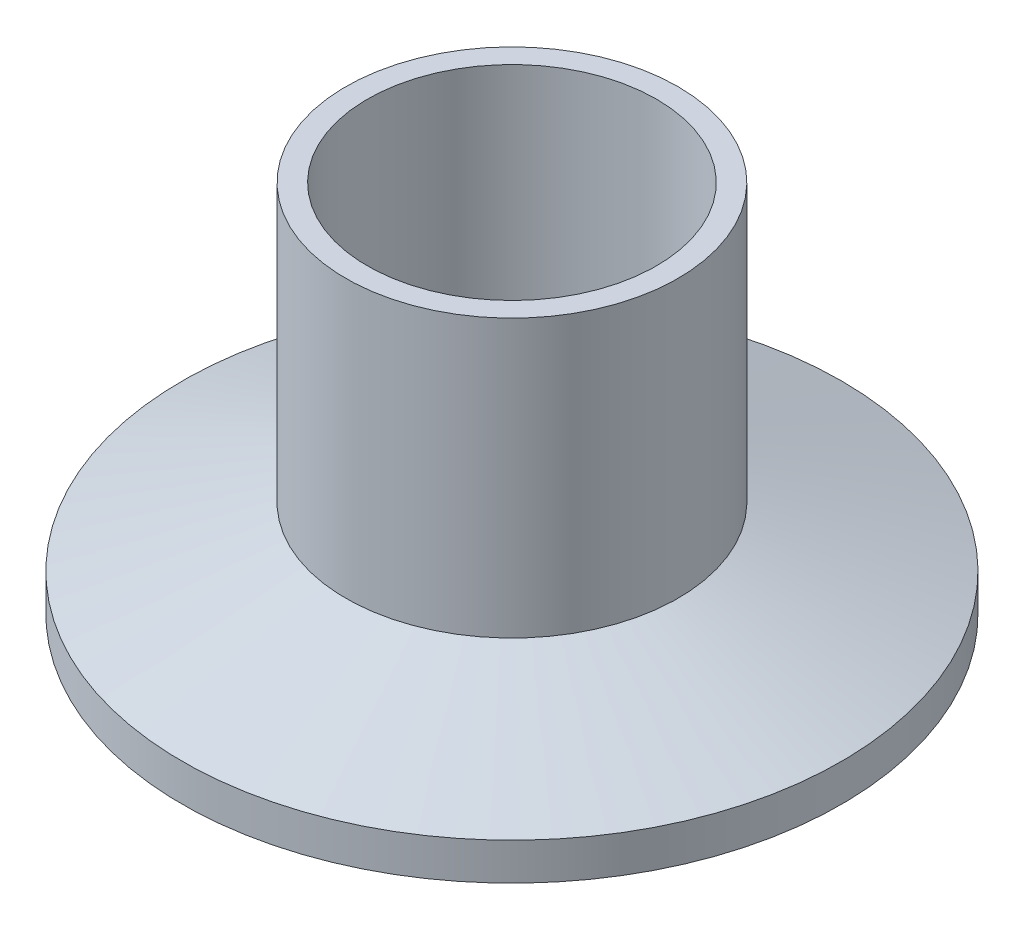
ISO-10303-21;
HEADER;
FILE_DESCRIPTION(('STEP AP214'),'2;1');
FILE_NAME('part.step','',(''),(''),'','','');
FILE_SCHEMA(('AUTOMOTIVE_DESIGN { 1 0 10303 214 1 1 1 1 }'));
ENDSEC;
DATA;
#1=APPLICATION_CONTEXT('core data for automotive mechanical design processes');
#2=APPLICATION_PROTOCOL_DEFINITION('international standard','automotive_design',2000,#1);
#3=PRODUCT_CONTEXT('',#1,'mechanical');
#4=PRODUCT('Part','Part','',(#3));
#5=PRODUCT_RELATED_PRODUCT_CATEGORY('part','',(#4));
#6=PRODUCT_DEFINITION_FORMATION('','',#4);
#7=PRODUCT_DEFINITION_CONTEXT('part definition',#1,'design');
#8=PRODUCT_DEFINITION('design','',#6,#7);
#9=PRODUCT_DEFINITION_SHAPE('','',#8);
#10=(LENGTH_UNIT() NAMED_UNIT(*) SI_UNIT(.MILLI.,.METRE.));
#11=(NAMED_UNIT(*) PLANE_ANGLE_UNIT() SI_UNIT($,.RADIAN.));
#12=(NAMED_UNIT(*) SI_UNIT($,.STERADIAN.) SOLID_ANGLE_UNIT());
#13=UNCERTAINTY_MEASURE_WITH_UNIT(LENGTH_MEASURE(1.E-05),#10,'distance_accuracy_value','');
#14=(GEOMETRIC_REPRESENTATION_CONTEXT(3) GLOBAL_UNCERTAINTY_ASSIGNED_CONTEXT((#13)) GLOBAL_UNIT_ASSIGNED_CONTEXT((#10,
#11,#12)) REPRESENTATION_CONTEXT('',''));
#15=CARTESIAN_POINT('',(0.,0.,0.));
#16=DIRECTION('',(0.,0.,1.));
#17=DIRECTION('',(1.,0.,0.));
#18=AXIS2_PLACEMENT_3D('',#15,#16,#17);
#19=CARTESIAN_POINT('',(0.,0.787400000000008,0.));
#20=DIRECTION('',(0.,-1.,0.));
#21=DIRECTION('',(0.,0.,-1.));
#22=AXIS2_PLACEMENT_3D('',#19,#20,#21);
#23=TOROIDAL_SURFACE('',#22,23.6366084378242,0.787399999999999);
#24=CARTESIAN_POINT('',(0.,0.,0.));
#25=DIRECTION('',(0.,-1.,0.));
#26=DIRECTION('',(0.,0.,-1.));
#27=AXIS2_PLACEMENT_3D('',#24,#25,#26);
#28=CIRCLE('',#27,23.6366084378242);
#29=CARTESIAN_POINT('',(0.,0.,-23.6366084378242));
#30=VERTEX_POINT('',#29);
#31=EDGE_CURVE('E74',#30,#30,#28,.T.);
#32=ORIENTED_EDGE('',*,*,#31,.T.);
#33=EDGE_LOOP('',(#32));
#34=FACE_BOUND('',#33,.T.);
#35=CARTESIAN_POINT('',(0.,0.474458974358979,0.));
#36=DIRECTION('',(0.,-1.,0.));
#37=DIRECTION('',(0.,0.,-1.));
#38=AXIS2_PLACEMENT_3D('',#35,#36,#37);
#39=CIRCLE('',#38,22.9140666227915);
#40=CARTESIAN_POINT('',(0.,0.47445897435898,-22.9140666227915));
#41=VERTEX_POINT('',#40);
#42=EDGE_CURVE('E12',#41,#41,#39,.T.);
#43=ORIENTED_EDGE('',*,*,#42,.F.);
#44=EDGE_LOOP('',(#43));
#45=FACE_BOUND('',#44,.T.);
#46=ADVANCED_FACE('F40',(#34,#45),#23,.T.);
#47=CARTESIAN_POINT('',(0.,0.,0.));
#48=DIRECTION('',(0.,-1.,0.));
#49=DIRECTION('',(0.,0.,-1.));
#50=AXIS2_PLACEMENT_3D('',#47,#48,#49);
#51=TOROIDAL_SURFACE('',#50,21.8186,1.1938);
#52=CARTESIAN_POINT('',(0.,0.474458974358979,0.));
#53=DIRECTION('',(0.,-1.,0.));
#54=DIRECTION('',(0.,0.,-1.));
#55=AXIS2_PLACEMENT_3D('',#52,#53,#54);
#56=CIRCLE('',#55,20.7231333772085);
#57=CARTESIAN_POINT('',(0.,0.47445897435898,-20.7231333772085));
#58=VERTEX_POINT('',#57);
#59=EDGE_CURVE('E46',#58,#58,#56,.T.);
#60=ORIENTED_EDGE('',*,*,#59,.F.);
#61=EDGE_LOOP('',(#60));
#62=FACE_BOUND('',#61,.T.);
#63=ORIENTED_EDGE('',*,*,#42,.T.);
#64=EDGE_LOOP('',(#63));
#65=FACE_BOUND('',#64,.T.);
#66=ADVANCED_FACE('F122',(#62,#65),#51,.F.);
#67=CARTESIAN_POINT('',(0.,0.787400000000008,0.));
#68=DIRECTION('',(0.,-1.,0.));
#69=DIRECTION('',(0.,0.,-1.));
#70=AXIS2_PLACEMENT_3D('',#67,#68,#69);
#71=TOROIDAL_SURFACE('',#70,20.0005915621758,0.787399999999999);
#72=ORIENTED_EDGE('',*,*,#59,.T.);
#73=EDGE_LOOP('',(#72));
#74=FACE_BOUND('',#73,.T.);
#75=CARTESIAN_POINT('',(0.,0.,0.));
#76=DIRECTION('',(0.,-1.,0.));
#77=DIRECTION('',(0.,0.,-1.));
#78=AXIS2_PLACEMENT_3D('',#75,#76,#77);
#79=CIRCLE('',#78,20.0005915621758);
#80=CARTESIAN_POINT('',(0.,0.,-20.0005915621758));
#81=VERTEX_POINT('',#80);
#82=EDGE_CURVE('E50',#81,#81,#79,.T.);
#83=ORIENTED_EDGE('',*,*,#82,.F.);
#84=EDGE_LOOP('',(#83));
#85=FACE_BOUND('',#84,.T.);
#86=ADVANCED_FACE('F118',(#74,#85),#71,.T.);
#87=CARTESIAN_POINT('',(0.,0.,0.));
#88=DIRECTION('',(0.,1.,0.));
#89=DIRECTION('',(0.,0.,1.));
#90=AXIS2_PLACEMENT_3D('',#87,#88,#89);
#91=PLANE('',#90);
#92=CARTESIAN_POINT('',(0.,0.,0.));
#93=DIRECTION('',(0.,-1.,0.));
#94=DIRECTION('',(0.,0.,-1.));
#95=AXIS2_PLACEMENT_3D('',#92,#93,#94);
#96=CIRCLE('',#95,11.049);
#97=CARTESIAN_POINT('',(0.,0.,-11.049));
#98=VERTEX_POINT('',#97);
#99=EDGE_CURVE('E54',#98,#98,#96,.T.);
#100=ORIENTED_EDGE('',*,*,#99,.F.);
#101=EDGE_LOOP('',(#100));
#102=FACE_BOUND('',#101,.T.);
#103=ORIENTED_EDGE('',*,*,#82,.T.);
#104=EDGE_LOOP('',(#103));
#105=FACE_BOUND('',#104,.T.);
#106=ADVANCED_FACE('F112',(#102,#105),#91,.F.);
#107=CARTESIAN_POINT('',(0.,0.,0.));
#108=DIRECTION('',(0.,-1.,0.));
#109=DIRECTION('',(0.,0.,-1.));
#110=AXIS2_PLACEMENT_3D('',#107,#108,#109);
#111=CYLINDRICAL_SURFACE('',#110,11.049);
#112=ORIENTED_EDGE('',*,*,#99,.T.);
#113=EDGE_LOOP('',(#112));
#114=FACE_BOUND('',#113,.T.);
#115=CARTESIAN_POINT('',(0.,28.575,0.));
#116=DIRECTION('',(0.,-1.,0.));
#117=DIRECTION('',(0.,0.,-1.));
#118=AXIS2_PLACEMENT_3D('',#115,#116,#117);
#119=CIRCLE('',#118,11.049);
#120=CARTESIAN_POINT('',(0.,28.575,-11.049));
#121=VERTEX_POINT('',#120);
#122=EDGE_CURVE('E59',#121,#121,#119,.T.);
#123=ORIENTED_EDGE('',*,*,#122,.F.);
#124=EDGE_LOOP('',(#123));
#125=FACE_BOUND('',#124,.T.);
#126=ADVANCED_FACE('F107',(#114,#125),#111,.F.);
#127=CARTESIAN_POINT('',(0.,28.575,0.));
#128=DIRECTION('',(0.,-1.,0.));
#129=DIRECTION('',(0.,0.,-1.));
#130=AXIS2_PLACEMENT_3D('',#127,#128,#129);
#131=PLANE('',#130);
#132=CARTESIAN_POINT('',(0.,28.575,0.));
#133=DIRECTION('',(0.,-1.,0.));
#134=DIRECTION('',(0.,0.,-1.));
#135=AXIS2_PLACEMENT_3D('',#132,#133,#134);
#136=CIRCLE('',#135,12.7);
#137=CARTESIAN_POINT('',(0.,28.575,-12.7));
#138=VERTEX_POINT('',#137);
#139=EDGE_CURVE('E62',#138,#138,#136,.T.);
#140=ORIENTED_EDGE('',*,*,#139,.F.);
#141=EDGE_LOOP('',(#140));
#142=FACE_BOUND('',#141,.T.);
#143=ORIENTED_EDGE('',*,*,#122,.T.);
#144=EDGE_LOOP('',(#143));
#145=FACE_BOUND('',#144,.T.);
#146=ADVANCED_FACE('F101',(#142,#145),#131,.F.);
#147=CARTESIAN_POINT('',(0.,0.,0.));
#148=DIRECTION('',(0.,-1.,0.));
#149=DIRECTION('',(0.,0.,-1.));
#150=AXIS2_PLACEMENT_3D('',#147,#148,#149);
#151=CYLINDRICAL_SURFACE('',#150,12.7);
#152=CARTESIAN_POINT('',(0.,7.39326322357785,0.));
#153=DIRECTION('',(0.,-1.,0.));
#154=DIRECTION('',(0.,0.,-1.));
#155=AXIS2_PLACEMENT_3D('',#152,#153,#154);
#156=CIRCLE('',#155,12.7);
#157=CARTESIAN_POINT('',(0.,7.39326322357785,-12.7));
#158=VERTEX_POINT('',#157);
#159=EDGE_CURVE('E65',#158,#158,#156,.T.);
#160=ORIENTED_EDGE('',*,*,#159,.F.);
#161=EDGE_LOOP('',(#160));
#162=FACE_BOUND('',#161,.T.);
#163=ORIENTED_EDGE('',*,*,#139,.T.);
#164=EDGE_LOOP('',(#163));
#165=FACE_BOUND('',#164,.T.);
#166=ADVANCED_FACE('F95',(#162,#165),#151,.T.);
#167=CARTESIAN_POINT('',(0.,7.39326322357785,0.));
#168=DIRECTION('',(0.,-1.,0.));
#169=DIRECTION('',(0.,0.,-1.));
#170=AXIS2_PLACEMENT_3D('',#167,#168,#169);
#171=CONICAL_SURFACE('',#170,12.7,1.22173047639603);
#172=CARTESIAN_POINT('',(0.,2.84480000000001,0.));
#173=DIRECTION('',(0.,-1.,0.));
#174=DIRECTION('',(0.,0.,-1.));
#175=AXIS2_PLACEMENT_3D('',#172,#173,#174);
#176=CIRCLE('',#175,25.1968);
#177=CARTESIAN_POINT('',(0.,2.84480000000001,-25.1968));
#178=VERTEX_POINT('',#177);
#179=EDGE_CURVE('E68',#178,#178,#176,.T.);
#180=ORIENTED_EDGE('',*,*,#179,.F.);
#181=EDGE_LOOP('',(#180));
#182=FACE_BOUND('',#181,.T.);
#183=ORIENTED_EDGE('',*,*,#159,.T.);
#184=EDGE_LOOP('',(#183));
#185=FACE_BOUND('',#184,.T.);
#186=ADVANCED_FACE('F89',(#182,#185),#171,.T.);
#187=CARTESIAN_POINT('',(0.,0.,0.));
#188=DIRECTION('',(0.,-1.,0.));
#189=DIRECTION('',(0.,0.,-1.));
#190=AXIS2_PLACEMENT_3D('',#187,#188,#189);
#191=CYLINDRICAL_SURFACE('',#190,25.1968);
#192=CARTESIAN_POINT('',(0.,0.,0.));
#193=DIRECTION('',(0.,-1.,0.));
#194=DIRECTION('',(0.,0.,-1.));
#195=AXIS2_PLACEMENT_3D('',#192,#193,#194);
#196=CIRCLE('',#195,25.1968);
#197=CARTESIAN_POINT('',(0.,0.,-25.1968));
#198=VERTEX_POINT('',#197);
#199=EDGE_CURVE('E71',#198,#198,#196,.T.);
#200=ORIENTED_EDGE('',*,*,#199,.F.);
#201=EDGE_LOOP('',(#200));
#202=FACE_BOUND('',#201,.T.);
#203=ORIENTED_EDGE('',*,*,#179,.T.);
#204=EDGE_LOOP('',(#203));
#205=FACE_BOUND('',#204,.T.);
#206=ADVANCED_FACE('F83',(#202,#205),#191,.T.);
#207=CARTESIAN_POINT('',(0.,0.,0.));
#208=DIRECTION('',(0.,1.,0.));
#209=DIRECTION('',(0.,0.,1.));
#210=AXIS2_PLACEMENT_3D('',#207,#208,#209);
#211=PLANE('',#210);
#212=ORIENTED_EDGE('',*,*,#31,.F.);
#213=EDGE_LOOP('',(#212));
#214=FACE_BOUND('',#213,.T.);
#215=ORIENTED_EDGE('',*,*,#199,.T.);
#216=EDGE_LOOP('',(#215));
#217=FACE_BOUND('',#216,.T.);
#218=ADVANCED_FACE('F80',(#214,#217),#211,.F.);
#219=CLOSED_SHELL('',(#46,#66,#86,#106,#126,#146,#166,#186,#206,#218));
#220=MANIFOLD_SOLID_BREP('B2',#219);
#221=ADVANCED_BREP_SHAPE_REPRESENTATION('',(#18,#220),#14);
#222=SHAPE_DEFINITION_REPRESENTATION(#9,#221);
ENDSEC;
END-ISO-10303-21;
